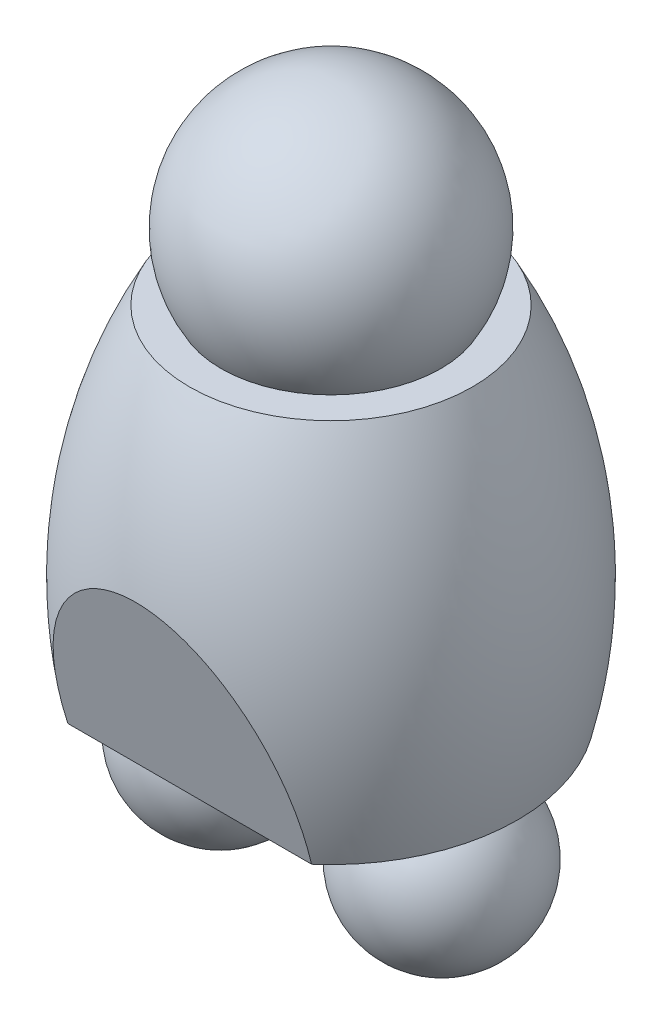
from build123d import *

# Parameters (mm, degrees)
CUT_EXTRUDE1_DEPTH = 15.976868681
ESCALA1_SCALE      = 6


with BuildPart() as part:
    # Sketch1 → Base-Revolve (revolve)
    with BuildSketch(Plane.XY):
        with BuildLine():
            Line((0, 17.399), (0, -17.399))
            Line((0, -17.399), (18.415, -17.399))
            ThreePointArc((18.415, -17.399), (19.460122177, 0.417396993), (13.97, 17.399))
            Line((13.97, 17.399), (0, 17.399))
        make_face()
    revolve(axis=Axis((0, 64.099865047, 0), (0, -1, 0)))

    # Sketch2 → Cut-Extrude1 (cut, symmetric)
    with BuildSketch(Plane(origin=(0, 0, 0), x_dir=(0, 0, -1), z_dir=(1, 0, 0))):
        Polygon((-13.944000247, -17.399), (-19.286363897, 1.651), (-22.841821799, 1.651), (-22.841821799, -17.894237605), (-13.944000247, -17.894237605), align=None)
        Polygon((19.796019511, -3.429), (22.737840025, -3.429), (22.737840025, -17.894237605), (14.094585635, -17.894237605), (14.094585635, -17.399), align=None)
    extrude(amount=CUT_EXTRUDE1_DEPTH, both=True, mode=Mode.SUBTRACT)

    # Sketch3 → Boss-Revolve1 (revolve)
    with BuildSketch(Plane.XY):
        with BuildLine():
            Line((0, 36.703), (0, 11.303))
            ThreePointArc((0, 11.303), (12.7, 24.003), (0, 36.703))
        make_face()
    revolve(axis=Axis((0, 0, 0), (0, 1, 0)))

    # Sketch5 → Boss-Revolve2 (revolve)
    with BuildSketch(Plane.XY):
        with BuildLine():
            Line((10.922, -16.2306), (10.922, -32.7914))
            ThreePointArc((10.922, -32.7914), (19.2024, -24.511), (10.922, -16.2306))
        make_face()
    boss_revolve2 = revolve(axis=Axis((10.922, -36.241550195, 0), (0, 1, 0)))

    # Mirror1: Boss-Revolve2 across plane
    add(boss_revolve2.mirror(Plane(origin=(0, 0, 0), x_dir=(0, 0, 1), z_dir=(1, 0, 0))))


with BuildPart() as part_1:
    # Escala1: scaled about (-1.79e-07, 0.806776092, -0.114453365)
    add(part.part.scale(ESCALA1_SCALE).moved(Location((8.95e-07, -4.03388046, 0.572266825))))


solid = part_1.part
